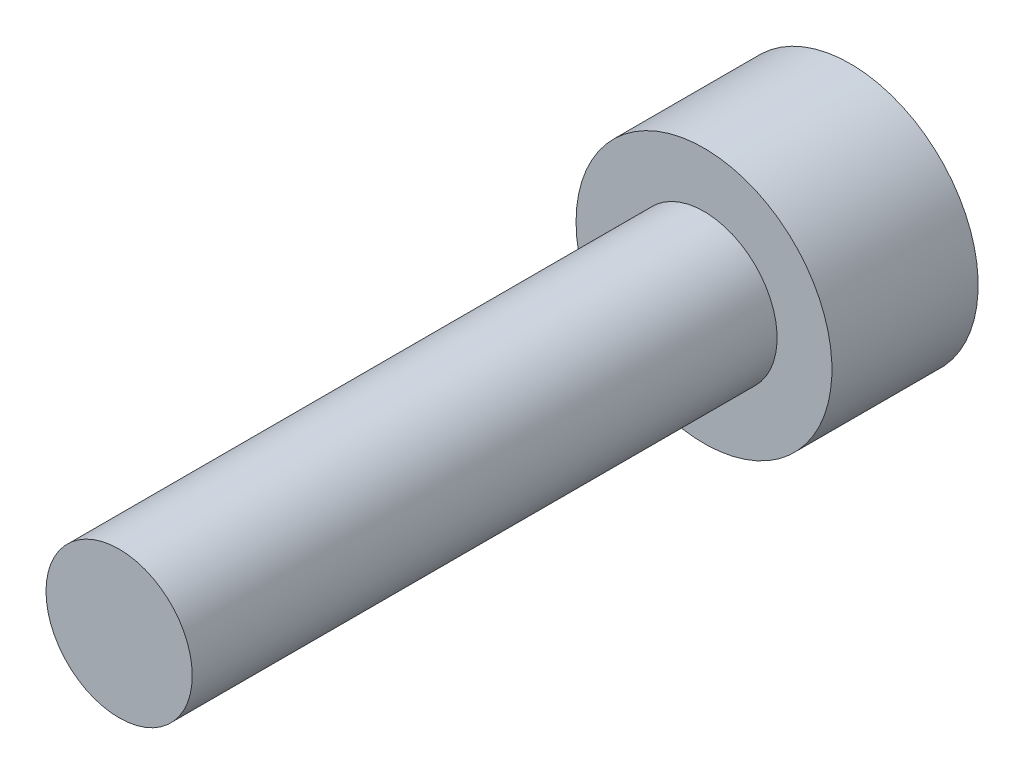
from build123d import *

# Parameters (mm, degrees)
SKETCH1_R           = 2
BASE_EXTRUDE_DEPTH  = 16
SKETCH2_R           = 3.5
BOSS_EXTRUDE1_DEPTH = 4
CUT_EXTRUDE1_DEPTH  = 3


with BuildPart() as part:
    # Sketch1 → Base-Extrude (new body)
    with BuildSketch(Plane.XY):
        Circle(SKETCH1_R)
    extrude(amount=BASE_EXTRUDE_DEPTH)

    # Sketch2 → Boss-Extrude1 (add)
    with BuildSketch(Plane(origin=(0, 0, 0), x_dir=(-1, 0, 0), z_dir=(0, 0, -1))):
        Circle(SKETCH2_R)
    extrude(amount=BOSS_EXTRUDE1_DEPTH)

    # Sketch3 → Cut-Extrude1 (cut)
    with BuildSketch(Plane(origin=(0, 0, -4), x_dir=(-1, 0, 0), z_dir=(0, 0, -1))):
        Polygon((-1.010683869, -1.847009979), (1.094215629, -1.798782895), (2.104899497, 0.048227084), (1.010683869, 1.847009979), (-1.094215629, 1.798782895), (-2.104899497, -0.048227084), align=None)
    extrude(amount=-CUT_EXTRUDE1_DEPTH, mode=Mode.SUBTRACT)


solid = part.part
